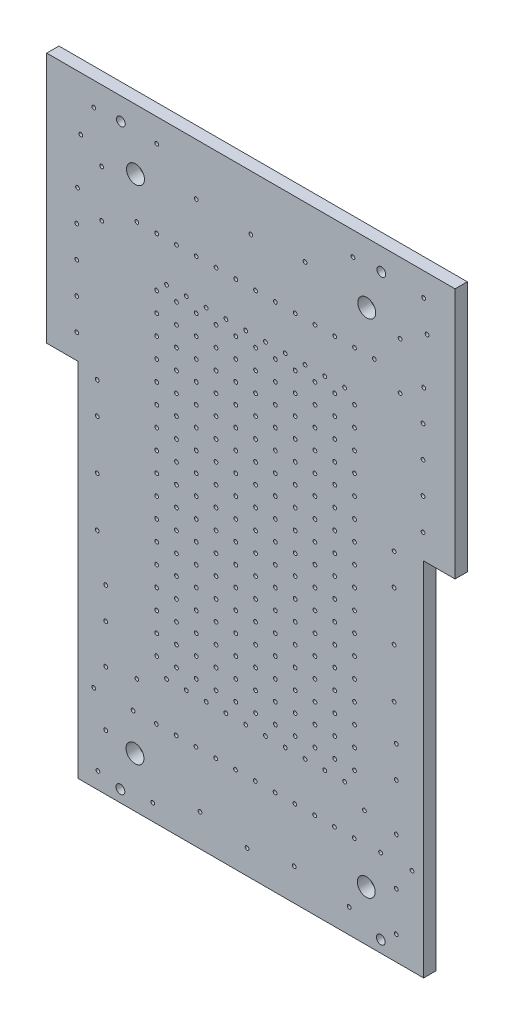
from build123d import *

# Parameters (mm, degrees)
SKETCH1_R           = 0.7239
SKETCH1_R_2         = 0.3556
SKETCH1_R_3         = 0.1524
BOSS_EXTRUDE1_DEPTH = 0.9910064


with BuildPart() as part:
    # Sketch1 → Boss-Extrude1 (new body)
    with BuildSketch(Plane.XY):
        Polygon((29.25, -3.290033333), (29.25, 25.919966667), (31.79, 25.919966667), (31.79, 46.239966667), (-1.23, 46.239966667), (-1.23, 25.919966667), (1.31, 25.919966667), (1.31, -3.290033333), align=None)
        with Locations(Location((5.95, 41.35, 0), (0, 0, 180))):
            Circle(SKETCH1_R, mode=Mode.SUBTRACT)
        with Locations(Location((24.65, 41.35, 0), (0, 0, 180))):
            Circle(SKETCH1_R, mode=Mode.SUBTRACT)
        with Locations(Location((4.77, 44.45, 0), (0, 0, 180))):
            Circle(SKETCH1_R_2, mode=Mode.SUBTRACT)
        with Locations(Location((25.83, 44.45, 0), (0, 0, 180))):
            Circle(SKETCH1_R_2, mode=Mode.SUBTRACT)
        with Locations(Location((18.785, -0.69, 0), (0, 0, 180))):
            Circle(SKETCH1_R_3, mode=Mode.SUBTRACT)
        with Locations(Location((14.975, -1.325, 0), (0, 0, 180))):
            Circle(SKETCH1_R_3, mode=Mode.SUBTRACT)
        with Locations(Location((11.165, -0.69, 0), (0, 0, 180))):
            Circle(SKETCH1_R_3, mode=Mode.SUBTRACT)
        with Locations(Location((2.91, -1.96, 0), (0, 0, 180))):
            Circle(SKETCH1_R_3, mode=Mode.SUBTRACT)
        with Locations(Location((7.355, -1.96, 0), (0, 0, 180))):
            Circle(SKETCH1_R_3, mode=Mode.SUBTRACT)
        with Locations(Location((23.23, -1.325, 0), (0, 0, 180))):
            Circle(SKETCH1_R_3, mode=Mode.SUBTRACT)
        with Locations(Location((27.04, -1.325, 0), (0, 0, 180))):
            Circle(SKETCH1_R_3, mode=Mode.SUBTRACT)
        with Locations(Location((3.545, 11.375, 0), (0, 0, 180))):
            Circle(SKETCH1_R_3, mode=Mode.SUBTRACT)
        with Locations(Location((3.545, 8.835, 0), (0, 0, 180))):
            Circle(SKETCH1_R_3, mode=Mode.SUBTRACT)
        with Locations(Location((27.04, 12.01, 0), (0, 0, 180))):
            Circle(SKETCH1_R_3, mode=Mode.SUBTRACT)
        with Locations(Location((27.04, 9.47, 0), (0, 0, 180))):
            Circle(SKETCH1_R_3, mode=Mode.SUBTRACT)
        with Locations(Location((28.31, 3.755, 0), (0, 0, 180))):
            Circle(SKETCH1_R_3, mode=Mode.SUBTRACT)
        with Locations(Location((27.04, 5.66, 0), (0, 0, 180))):
            Circle(SKETCH1_R_3, mode=Mode.SUBTRACT)
        with Locations(Location((25.77, 3.755, 0), (0, 0, 180))):
            Circle(SKETCH1_R_3, mode=Mode.SUBTRACT)
        with Locations(Location((27.04, 1.85, 0), (0, 0, 180))):
            Circle(SKETCH1_R_3, mode=Mode.SUBTRACT)
        with Locations(Location((3.545, 5.66, 0), (0, 0, 180))):
            Circle(SKETCH1_R_3, mode=Mode.SUBTRACT)
        with Locations(Location((2.58, 3.694966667, 0), (0, 0, 180))):
            Circle(SKETCH1_R_3, mode=Mode.SUBTRACT)
        with Locations(Location((3.545, 1.215, 0), (0, 0, 180))):
            Circle(SKETCH1_R_3, mode=Mode.SUBTRACT)
        with Locations(Location((5.755, 3.694966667, 0), (0, 0, 180))):
            Circle(SKETCH1_R_3, mode=Mode.SUBTRACT)
        with Locations(Location((27.345, 36.714966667, 0), (0, 0, 180))):
            Circle(SKETCH1_R_3, mode=Mode.SUBTRACT)
        with Locations(Location((27.345, 40.524966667, 0), (0, 0, 180))):
            Circle(SKETCH1_R_3, mode=Mode.SUBTRACT)
        with Locations(Location((2.58, 44.334966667, 0), (0, 0, 180))):
            Circle(SKETCH1_R_3, mode=Mode.SUBTRACT)
        with Locations(Location((7.66, 44.334966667, 0), (0, 0, 180))):
            Circle(SKETCH1_R_3, mode=Mode.SUBTRACT)
        with Locations(Location((29.25, 44.334966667, 0), (0, 0, 180))):
            Circle(SKETCH1_R_3, mode=Mode.SUBTRACT)
        with Locations(Location((23.535, 44.334966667, 0), (0, 0, 180))):
            Circle(SKETCH1_R_3, mode=Mode.SUBTRACT)
        with Locations(Location((15.28, 41.794966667, 0), (0, 0, 180))):
            Circle(SKETCH1_R_3, mode=Mode.SUBTRACT)
        with Locations(Location((3.215, 40.524966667, 0), (0, 0, 180))):
            Circle(SKETCH1_R_3, mode=Mode.SUBTRACT)
        with Locations(Location((3.215, 36.714966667, 0), (0, 0, 180))):
            Circle(SKETCH1_R_3, mode=Mode.SUBTRACT)
        with Locations(Location((29.53, 41.909966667, 0), (0, 0, 180))):
            Circle(SKETCH1_R_3, mode=Mode.SUBTRACT)
        with Locations(Location((1.53, 41.909966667, 0), (0, 0, 180))):
            Circle(SKETCH1_R_3, mode=Mode.SUBTRACT)
        with Locations(Location((26.86, 25.399966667, 0), (0, 0, 180))):
            Circle(SKETCH1_R_3, mode=Mode.SUBTRACT)
        with Locations(Location((2.86, 25.399966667, 0), (0, 0, 180))):
            Circle(SKETCH1_R_3, mode=Mode.SUBTRACT)
        with Locations(Location((29.2, 27.899966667, 0), (0, 0, 180))):
            Circle(SKETCH1_R_3, mode=Mode.SUBTRACT)
        with Locations(Location((1.2, 27.899966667, 0), (0, 0, 180))):
            Circle(SKETCH1_R_3, mode=Mode.SUBTRACT)
        with Locations(Location((29.2, 30.439966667, 0), (0, 0, 180))):
            Circle(SKETCH1_R_3, mode=Mode.SUBTRACT)
        with Locations(Location((1.2, 30.439966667, 0), (0, 0, 180))):
            Circle(SKETCH1_R_3, mode=Mode.SUBTRACT)
        with Locations(Location((29.2, 32.979966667, 0), (0, 0, 180))):
            Circle(SKETCH1_R_3, mode=Mode.SUBTRACT)
        with Locations(Location((1.2, 32.979966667, 0), (0, 0, 180))):
            Circle(SKETCH1_R_3, mode=Mode.SUBTRACT)
        with Locations(Location((23.66, 10.06, 0), (0, 0, 180))):
            Circle(SKETCH1_R_3, mode=Mode.SUBTRACT)
        with Locations(Location((23.66, 13.26, 0), (0, 0, 180))):
            Circle(SKETCH1_R_3, mode=Mode.SUBTRACT)
        with Locations(Location((23.66, 16.46, 0), (0, 0, 180))):
            Circle(SKETCH1_R_3, mode=Mode.SUBTRACT)
        with Locations(Location((23.66, 19.66, 0), (0, 0, 180))):
            Circle(SKETCH1_R_3, mode=Mode.SUBTRACT)
        with Locations(Location((23.66, 22.86, 0), (0, 0, 180))):
            Circle(SKETCH1_R_3, mode=Mode.SUBTRACT)
        with Locations(Location((23.66, 32.46, 0), (0, 0, 180))):
            Circle(SKETCH1_R_3, mode=Mode.SUBTRACT)
        with Locations(Location((22.06, 10.06, 0), (0, 0, 180))):
            Circle(SKETCH1_R_3, mode=Mode.SUBTRACT)
        with Locations(Location((22.06, 13.26, 0), (0, 0, 180))):
            Circle(SKETCH1_R_3, mode=Mode.SUBTRACT)
        with Locations(Location((22.06, 16.46, 0), (0, 0, 180))):
            Circle(SKETCH1_R_3, mode=Mode.SUBTRACT)
        with Locations(Location((22.06, 19.66, 0), (0, 0, 180))):
            Circle(SKETCH1_R_3, mode=Mode.SUBTRACT)
        with Locations(Location((22.06, 22.86, 0), (0, 0, 180))):
            Circle(SKETCH1_R_3, mode=Mode.SUBTRACT)
        with Locations(Location((22.06, 32.46, 0), (0, 0, 180))):
            Circle(SKETCH1_R_3, mode=Mode.SUBTRACT)
        with Locations(Location((20.46, 10.06, 0), (0, 0, 180))):
            Circle(SKETCH1_R_3, mode=Mode.SUBTRACT)
        with Locations(Location((20.46, 13.26, 0), (0, 0, 180))):
            Circle(SKETCH1_R_3, mode=Mode.SUBTRACT)
        with Locations(Location((20.46, 16.46, 0), (0, 0, 180))):
            Circle(SKETCH1_R_3, mode=Mode.SUBTRACT)
        with Locations(Location((20.46, 19.66, 0), (0, 0, 180))):
            Circle(SKETCH1_R_3, mode=Mode.SUBTRACT)
        with Locations(Location((20.46, 22.86, 0), (0, 0, 180))):
            Circle(SKETCH1_R_3, mode=Mode.SUBTRACT)
        with Locations(Location((20.46, 32.46, 0), (0, 0, 180))):
            Circle(SKETCH1_R_3, mode=Mode.SUBTRACT)
        with Locations(Location((18.86, 10.06, 0), (0, 0, 180))):
            Circle(SKETCH1_R_3, mode=Mode.SUBTRACT)
        with Locations(Location((18.86, 13.26, 0), (0, 0, 180))):
            Circle(SKETCH1_R_3, mode=Mode.SUBTRACT)
        with Locations(Location((18.86, 16.46, 0), (0, 0, 180))):
            Circle(SKETCH1_R_3, mode=Mode.SUBTRACT)
        with Locations(Location((18.86, 19.66, 0), (0, 0, 180))):
            Circle(SKETCH1_R_3, mode=Mode.SUBTRACT)
        with Locations(Location((18.86, 22.86, 0), (0, 0, 180))):
            Circle(SKETCH1_R_3, mode=Mode.SUBTRACT)
        with Locations(Location((18.86, 32.46, 0), (0, 0, 180))):
            Circle(SKETCH1_R_3, mode=Mode.SUBTRACT)
        with Locations(Location((17.26, 10.06, 0), (0, 0, 180))):
            Circle(SKETCH1_R_3, mode=Mode.SUBTRACT)
        with Locations(Location((17.26, 13.26, 0), (0, 0, 180))):
            Circle(SKETCH1_R_3, mode=Mode.SUBTRACT)
        with Locations(Location((17.26, 16.46, 0), (0, 0, 180))):
            Circle(SKETCH1_R_3, mode=Mode.SUBTRACT)
        with Locations(Location((17.26, 19.66, 0), (0, 0, 180))):
            Circle(SKETCH1_R_3, mode=Mode.SUBTRACT)
        with Locations(Location((17.26, 22.86, 0), (0, 0, 180))):
            Circle(SKETCH1_R_3, mode=Mode.SUBTRACT)
        with Locations(Location((17.26, 32.46, 0), (0, 0, 180))):
            Circle(SKETCH1_R_3, mode=Mode.SUBTRACT)
        with Locations(Location((15.66, 10.06, 0), (0, 0, 180))):
            Circle(SKETCH1_R_3, mode=Mode.SUBTRACT)
        with Locations(Location((15.66, 13.26, 0), (0, 0, 180))):
            Circle(SKETCH1_R_3, mode=Mode.SUBTRACT)
        with Locations(Location((15.66, 16.46, 0), (0, 0, 180))):
            Circle(SKETCH1_R_3, mode=Mode.SUBTRACT)
        with Locations(Location((15.66, 19.66, 0), (0, 0, 180))):
            Circle(SKETCH1_R_3, mode=Mode.SUBTRACT)
        with Locations(Location((15.66, 22.86, 0), (0, 0, 180))):
            Circle(SKETCH1_R_3, mode=Mode.SUBTRACT)
        with Locations(Location((15.66, 32.46, 0), (0, 0, 180))):
            Circle(SKETCH1_R_3, mode=Mode.SUBTRACT)
        with Locations(Location((14.06, 10.06, 0), (0, 0, 180))):
            Circle(SKETCH1_R_3, mode=Mode.SUBTRACT)
        with Locations(Location((14.06, 13.26, 0), (0, 0, 180))):
            Circle(SKETCH1_R_3, mode=Mode.SUBTRACT)
        with Locations(Location((14.06, 16.46, 0), (0, 0, 180))):
            Circle(SKETCH1_R_3, mode=Mode.SUBTRACT)
        with Locations(Location((23.66, 26.06, 0), (0, 0, 180))):
            Circle(SKETCH1_R_3, mode=Mode.SUBTRACT)
        with Locations(Location((14.06, 19.66, 0), (0, 0, 180))):
            Circle(SKETCH1_R_3, mode=Mode.SUBTRACT)
        with Locations(Location((23.66, 29.26, 0), (0, 0, 180))):
            Circle(SKETCH1_R_3, mode=Mode.SUBTRACT)
        with Locations(Location((14.06, 22.86, 0), (0, 0, 180))):
            Circle(SKETCH1_R_3, mode=Mode.SUBTRACT)
        with Locations(Location((14.06, 32.46, 0), (0, 0, 180))):
            Circle(SKETCH1_R_3, mode=Mode.SUBTRACT)
        with Locations(Location((22.06, 26.06, 0), (0, 0, 180))):
            Circle(SKETCH1_R_3, mode=Mode.SUBTRACT)
        with Locations(Location((12.46, 10.06, 0), (0, 0, 180))):
            Circle(SKETCH1_R_3, mode=Mode.SUBTRACT)
        with Locations(Location((22.06, 29.26, 0), (0, 0, 180))):
            Circle(SKETCH1_R_3, mode=Mode.SUBTRACT)
        with Locations(Location((12.46, 13.26, 0), (0, 0, 180))):
            Circle(SKETCH1_R_3, mode=Mode.SUBTRACT)
        with Locations(Location((20.46, 26.06, 0), (0, 0, 180))):
            Circle(SKETCH1_R_3, mode=Mode.SUBTRACT)
        with Locations(Location((12.46, 16.46, 0), (0, 0, 180))):
            Circle(SKETCH1_R_3, mode=Mode.SUBTRACT)
        with Locations(Location((20.46, 29.26, 0), (0, 0, 180))):
            Circle(SKETCH1_R_3, mode=Mode.SUBTRACT)
        with Locations(Location((12.46, 19.66, 0), (0, 0, 180))):
            Circle(SKETCH1_R_3, mode=Mode.SUBTRACT)
        with Locations(Location((18.86, 26.06, 0), (0, 0, 180))):
            Circle(SKETCH1_R_3, mode=Mode.SUBTRACT)
        with Locations(Location((12.46, 22.86, 0), (0, 0, 180))):
            Circle(SKETCH1_R_3, mode=Mode.SUBTRACT)
        with Locations(Location((23.635, 3.694966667, 0), (0, 0, 180))):
            Circle(SKETCH1_R_3, mode=Mode.SUBTRACT)
        with Locations(Location((24.46, 6.059966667, 0), (0, 0, 180))):
            Circle(SKETCH1_R_3, mode=Mode.SUBTRACT)
        with Locations(Location((26.86, 14.859966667, 0), (0, 0, 180))):
            Circle(SKETCH1_R_3, mode=Mode.SUBTRACT)
        with Locations(Location((26.86, 18.859966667, 0), (0, 0, 180))):
            Circle(SKETCH1_R_3, mode=Mode.SUBTRACT)
        with Locations(Location((26.86, 22.859966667, 0), (0, 0, 180))):
            Circle(SKETCH1_R_3, mode=Mode.SUBTRACT)
        with Locations(Location((12.46, 32.46, 0), (0, 0, 180))):
            Circle(SKETCH1_R_3, mode=Mode.SUBTRACT)
        with Locations(Location((25.26, 38.059966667, 0), (0, 0, 180))):
            Circle(SKETCH1_R_3, mode=Mode.SUBTRACT)
        with Locations(Location((29.26, 38.059966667, 0), (0, 0, 180))):
            Circle(SKETCH1_R_3, mode=Mode.SUBTRACT)
        with Locations(Location((19.66, 42.059966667, 0), (0, 0, 180))):
            Circle(SKETCH1_R_3, mode=Mode.SUBTRACT)
        with Locations(Location((10.86, 42.059966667, 0), (0, 0, 180))):
            Circle(SKETCH1_R_3, mode=Mode.SUBTRACT)
        with Locations(Location((2.86, 14.859966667, 0), (0, 0, 180))):
            Circle(SKETCH1_R_3, mode=Mode.SUBTRACT)
        with Locations(Location((2.86, 18.859966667, 0), (0, 0, 180))):
            Circle(SKETCH1_R_3, mode=Mode.SUBTRACT)
        with Locations(Location((2.86, 22.859966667, 0), (0, 0, 180))):
            Circle(SKETCH1_R_3, mode=Mode.SUBTRACT)
        with Locations(Location((18.86, 29.26, 0), (0, 0, 180))):
            Circle(SKETCH1_R_3, mode=Mode.SUBTRACT)
        with Locations(Location((1.26, 38.059966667, 0), (0, 0, 180))):
            Circle(SKETCH1_R_3, mode=Mode.SUBTRACT)
        with Locations(Location((10.86, 10.06, 0), (0, 0, 180))):
            Circle(SKETCH1_R_3, mode=Mode.SUBTRACT)
        with Locations(Location((6.06, 6.06, 0), (0, 0, 180))):
            Circle(SKETCH1_R_3, mode=Mode.SUBTRACT)
        with Locations(Location((22.035, 3.694966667, 0), (0, 0, 180))):
            Circle(SKETCH1_R_3, mode=Mode.SUBTRACT)
        with Locations(Location((20.435, 3.694966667, 0), (0, 0, 180))):
            Circle(SKETCH1_R_3, mode=Mode.SUBTRACT)
        with Locations(Location((18.835, 3.694966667, 0), (0, 0, 180))):
            Circle(SKETCH1_R_3, mode=Mode.SUBTRACT)
        with Locations(Location((17.235, 3.694966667, 0), (0, 0, 180))):
            Circle(SKETCH1_R_3, mode=Mode.SUBTRACT)
        with Locations(Location((15.635, 3.694966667, 0), (0, 0, 180))):
            Circle(SKETCH1_R_3, mode=Mode.SUBTRACT)
        with Locations(Location((14.035, 3.694966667, 0), (0, 0, 180))):
            Circle(SKETCH1_R_3, mode=Mode.SUBTRACT)
        with Locations(Location((12.435, 3.694966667, 0), (0, 0, 180))):
            Circle(SKETCH1_R_3, mode=Mode.SUBTRACT)
        with Locations(Location((10.835, 3.694966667, 0), (0, 0, 180))):
            Circle(SKETCH1_R_3, mode=Mode.SUBTRACT)
        with Locations(Location((9.235, 3.694966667, 0), (0, 0, 180))):
            Circle(SKETCH1_R_3, mode=Mode.SUBTRACT)
        with Locations(Location((7.635, 3.694966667, 0), (0, 0, 180))):
            Circle(SKETCH1_R_3, mode=Mode.SUBTRACT)
        with Locations(Location((22.06, 38.059966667, 0), (0, 0, 180))):
            Circle(SKETCH1_R_3, mode=Mode.SUBTRACT)
        with Locations(Location((23.66, 38.059966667, 0), (0, 0, 180))):
            Circle(SKETCH1_R_3, mode=Mode.SUBTRACT)
        with Locations(Location((20.46, 38.059966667, 0), (0, 0, 180))):
            Circle(SKETCH1_R_3, mode=Mode.SUBTRACT)
        with Locations(Location((18.86, 38.059966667, 0), (0, 0, 180))):
            Circle(SKETCH1_R_3, mode=Mode.SUBTRACT)
        with Locations(Location((17.26, 38.059966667, 0), (0, 0, 180))):
            Circle(SKETCH1_R_3, mode=Mode.SUBTRACT)
        with Locations(Location((15.66, 38.059966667, 0), (0, 0, 180))):
            Circle(SKETCH1_R_3, mode=Mode.SUBTRACT)
        with Locations(Location((14.06, 38.059966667, 0), (0, 0, 180))):
            Circle(SKETCH1_R_3, mode=Mode.SUBTRACT)
        with Locations(Location((12.46, 38.059966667, 0), (0, 0, 180))):
            Circle(SKETCH1_R_3, mode=Mode.SUBTRACT)
        with Locations(Location((10.86, 38.059966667, 0), (0, 0, 180))):
            Circle(SKETCH1_R_3, mode=Mode.SUBTRACT)
        with Locations(Location((9.26, 38.059966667, 0), (0, 0, 180))):
            Circle(SKETCH1_R_3, mode=Mode.SUBTRACT)
        with Locations(Location((7.66, 38.059966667, 0), (0, 0, 180))):
            Circle(SKETCH1_R_3, mode=Mode.SUBTRACT)
        with Locations(Location((6.06, 38.059966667, 0), (0, 0, 180))):
            Circle(SKETCH1_R_3, mode=Mode.SUBTRACT)
        with Locations(Location((23.66, 8.46, 0), (0, 0, 180))):
            Circle(SKETCH1_R_3, mode=Mode.SUBTRACT)
        with Locations(Location((17.26, 26.06, 0), (0, 0, 180))):
            Circle(SKETCH1_R_3, mode=Mode.SUBTRACT)
        with Locations(Location((23.66, 11.66, 0), (0, 0, 180))):
            Circle(SKETCH1_R_3, mode=Mode.SUBTRACT)
        with Locations(Location((10.86, 13.26, 0), (0, 0, 180))):
            Circle(SKETCH1_R_3, mode=Mode.SUBTRACT)
        with Locations(Location((23.66, 14.86, 0), (0, 0, 180))):
            Circle(SKETCH1_R_3, mode=Mode.SUBTRACT)
        with Locations(Location((17.26, 29.26, 0), (0, 0, 180))):
            Circle(SKETCH1_R_3, mode=Mode.SUBTRACT)
        with Locations(Location((23.66, 18.06, 0), (0, 0, 180))):
            Circle(SKETCH1_R_3, mode=Mode.SUBTRACT)
        with Locations(Location((10.86, 16.46, 0), (0, 0, 180))):
            Circle(SKETCH1_R_3, mode=Mode.SUBTRACT)
        with Locations(Location((23.66, 21.26, 0), (0, 0, 180))):
            Circle(SKETCH1_R_3, mode=Mode.SUBTRACT)
        with Locations(Location((15.66, 26.06, 0), (0, 0, 180))):
            Circle(SKETCH1_R_3, mode=Mode.SUBTRACT)
        with Locations(Location((23.66, 24.46, 0), (0, 0, 180))):
            Circle(SKETCH1_R_3, mode=Mode.SUBTRACT)
        with Locations(Location((23.66, 34.06, 0), (0, 0, 180))):
            Circle(SKETCH1_R_3, mode=Mode.SUBTRACT)
        with Locations(Location((22.06, 8.46, 0), (0, 0, 180))):
            Circle(SKETCH1_R_3, mode=Mode.SUBTRACT)
        with Locations(Location((10.86, 19.66, 0), (0, 0, 180))):
            Circle(SKETCH1_R_3, mode=Mode.SUBTRACT)
        with Locations(Location((22.06, 11.66, 0), (0, 0, 180))):
            Circle(SKETCH1_R_3, mode=Mode.SUBTRACT)
        with Locations(Location((15.66, 29.26, 0), (0, 0, 180))):
            Circle(SKETCH1_R_3, mode=Mode.SUBTRACT)
        with Locations(Location((22.06, 14.86, 0), (0, 0, 180))):
            Circle(SKETCH1_R_3, mode=Mode.SUBTRACT)
        with Locations(Location((10.86, 22.86, 0), (0, 0, 180))):
            Circle(SKETCH1_R_3, mode=Mode.SUBTRACT)
        with Locations(Location((22.06, 18.06, 0), (0, 0, 180))):
            Circle(SKETCH1_R_3, mode=Mode.SUBTRACT)
        with Locations(Location((10.86, 32.46, 0), (0, 0, 180))):
            Circle(SKETCH1_R_3, mode=Mode.SUBTRACT)
        with Locations(Location((22.06, 21.26, 0), (0, 0, 180))):
            Circle(SKETCH1_R_3, mode=Mode.SUBTRACT)
        with Locations(Location((14.06, 26.06, 0), (0, 0, 180))):
            Circle(SKETCH1_R_3, mode=Mode.SUBTRACT)
        with Locations(Location((22.06, 24.46, 0), (0, 0, 180))):
            Circle(SKETCH1_R_3, mode=Mode.SUBTRACT)
        with Locations(Location((22.06, 34.06, 0), (0, 0, 180))):
            Circle(SKETCH1_R_3, mode=Mode.SUBTRACT)
        with Locations(Location((20.46, 8.46, 0), (0, 0, 180))):
            Circle(SKETCH1_R_3, mode=Mode.SUBTRACT)
        with Locations(Location((9.26, 10.06, 0), (0, 0, 180))):
            Circle(SKETCH1_R_3, mode=Mode.SUBTRACT)
        with Locations(Location((20.46, 11.66, 0), (0, 0, 180))):
            Circle(SKETCH1_R_3, mode=Mode.SUBTRACT)
        with Locations(Location((14.06, 29.26, 0), (0, 0, 180))):
            Circle(SKETCH1_R_3, mode=Mode.SUBTRACT)
        with Locations(Location((20.46, 14.86, 0), (0, 0, 180))):
            Circle(SKETCH1_R_3, mode=Mode.SUBTRACT)
        with Locations(Location((9.26, 13.26, 0), (0, 0, 180))):
            Circle(SKETCH1_R_3, mode=Mode.SUBTRACT)
        with Locations(Location((20.46, 18.06, 0), (0, 0, 180))):
            Circle(SKETCH1_R_3, mode=Mode.SUBTRACT)
        with Locations(Location((12.46, 26.06, 0), (0, 0, 180))):
            Circle(SKETCH1_R_3, mode=Mode.SUBTRACT)
        with Locations(Location((20.46, 21.26, 0), (0, 0, 180))):
            Circle(SKETCH1_R_3, mode=Mode.SUBTRACT)
        with Locations(Location((9.26, 16.46, 0), (0, 0, 180))):
            Circle(SKETCH1_R_3, mode=Mode.SUBTRACT)
        with Locations(Location((20.46, 24.46, 0), (0, 0, 180))):
            Circle(SKETCH1_R_3, mode=Mode.SUBTRACT)
        with Locations(Location((20.46, 34.06, 0), (0, 0, 180))):
            Circle(SKETCH1_R_3, mode=Mode.SUBTRACT)
        with Locations(Location((18.86, 8.46, 0), (0, 0, 180))):
            Circle(SKETCH1_R_3, mode=Mode.SUBTRACT)
        with Locations(Location((12.46, 29.26, 0), (0, 0, 180))):
            Circle(SKETCH1_R_3, mode=Mode.SUBTRACT)
        with Locations(Location((18.86, 11.66, 0), (0, 0, 180))):
            Circle(SKETCH1_R_3, mode=Mode.SUBTRACT)
        with Locations(Location((9.26, 19.66, 0), (0, 0, 180))):
            Circle(SKETCH1_R_3, mode=Mode.SUBTRACT)
        with Locations(Location((18.86, 14.86, 0), (0, 0, 180))):
            Circle(SKETCH1_R_3, mode=Mode.SUBTRACT)
        with Locations(Location((10.86, 26.06, 0), (0, 0, 180))):
            Circle(SKETCH1_R_3, mode=Mode.SUBTRACT)
        with Locations(Location((18.86, 18.06, 0), (0, 0, 180))):
            Circle(SKETCH1_R_3, mode=Mode.SUBTRACT)
        with Locations(Location((9.26, 22.86, 0), (0, 0, 180))):
            Circle(SKETCH1_R_3, mode=Mode.SUBTRACT)
        with Locations(Location((18.86, 21.26, 0), (0, 0, 180))):
            Circle(SKETCH1_R_3, mode=Mode.SUBTRACT)
        with Locations(Location((9.26, 32.46, 0), (0, 0, 180))):
            Circle(SKETCH1_R_3, mode=Mode.SUBTRACT)
        with Locations(Location((18.86, 24.46, 0), (0, 0, 180))):
            Circle(SKETCH1_R_3, mode=Mode.SUBTRACT)
        with Locations(Location((18.86, 34.06, 0), (0, 0, 180))):
            Circle(SKETCH1_R_3, mode=Mode.SUBTRACT)
        with Locations(Location((17.26, 8.46, 0), (0, 0, 180))):
            Circle(SKETCH1_R_3, mode=Mode.SUBTRACT)
        with Locations(Location((10.86, 29.26, 0), (0, 0, 180))):
            Circle(SKETCH1_R_3, mode=Mode.SUBTRACT)
        with Locations(Location((17.26, 11.66, 0), (0, 0, 180))):
            Circle(SKETCH1_R_3, mode=Mode.SUBTRACT)
        with Locations(Location((7.66, 10.06, 0), (0, 0, 180))):
            Circle(SKETCH1_R_3, mode=Mode.SUBTRACT)
        with Locations(Location((17.26, 14.86, 0), (0, 0, 180))):
            Circle(SKETCH1_R_3, mode=Mode.SUBTRACT)
        with Locations(Location((9.26, 26.06, 0), (0, 0, 180))):
            Circle(SKETCH1_R_3, mode=Mode.SUBTRACT)
        with Locations(Location((17.26, 18.06, 0), (0, 0, 180))):
            Circle(SKETCH1_R_3, mode=Mode.SUBTRACT)
        with Locations(Location((7.66, 13.26, 0), (0, 0, 180))):
            Circle(SKETCH1_R_3, mode=Mode.SUBTRACT)
        with Locations(Location((17.26, 21.26, 0), (0, 0, 180))):
            Circle(SKETCH1_R_3, mode=Mode.SUBTRACT)
        with Locations(Location((9.26, 29.26, 0), (0, 0, 180))):
            Circle(SKETCH1_R_3, mode=Mode.SUBTRACT)
        with Locations(Location((17.26, 24.46, 0), (0, 0, 180))):
            Circle(SKETCH1_R_3, mode=Mode.SUBTRACT)
        with Locations(Location((17.26, 34.06, 0), (0, 0, 180))):
            Circle(SKETCH1_R_3, mode=Mode.SUBTRACT)
        with Locations(Location((15.66, 8.46, 0), (0, 0, 180))):
            Circle(SKETCH1_R_3, mode=Mode.SUBTRACT)
        with Locations(Location((7.66, 16.46, 0), (0, 0, 180))):
            Circle(SKETCH1_R_3, mode=Mode.SUBTRACT)
        with Locations(Location((15.66, 11.66, 0), (0, 0, 180))):
            Circle(SKETCH1_R_3, mode=Mode.SUBTRACT)
        with Locations(Location((7.66, 26.06, 0), (0, 0, 180))):
            Circle(SKETCH1_R_3, mode=Mode.SUBTRACT)
        with Locations(Location((15.66, 14.86, 0), (0, 0, 180))):
            Circle(SKETCH1_R_3, mode=Mode.SUBTRACT)
        with Locations(Location((7.66, 19.66, 0), (0, 0, 180))):
            Circle(SKETCH1_R_3, mode=Mode.SUBTRACT)
        with Locations(Location((15.66, 18.06, 0), (0, 0, 180))):
            Circle(SKETCH1_R_3, mode=Mode.SUBTRACT)
        with Locations(Location((7.66, 29.26, 0), (0, 0, 180))):
            Circle(SKETCH1_R_3, mode=Mode.SUBTRACT)
        with Locations(Location((15.66, 21.26, 0), (0, 0, 180))):
            Circle(SKETCH1_R_3, mode=Mode.SUBTRACT)
        with Locations(Location((7.66, 22.86, 0), (0, 0, 180))):
            Circle(SKETCH1_R_3, mode=Mode.SUBTRACT)
        with Locations(Location((15.66, 24.46, 0), (0, 0, 180))):
            Circle(SKETCH1_R_3, mode=Mode.SUBTRACT)
        with Locations(Location((15.66, 34.06, 0), (0, 0, 180))):
            Circle(SKETCH1_R_3, mode=Mode.SUBTRACT)
        with Locations(Location((14.06, 8.46, 0), (0, 0, 180))):
            Circle(SKETCH1_R_3, mode=Mode.SUBTRACT)
        with Locations(Location((7.66, 32.46, 0), (0, 0, 180))):
            Circle(SKETCH1_R_3, mode=Mode.SUBTRACT)
        with Locations(Location((14.06, 11.66, 0), (0, 0, 180))):
            Circle(SKETCH1_R_3, mode=Mode.SUBTRACT)
        with Locations(Location((29.2, 35.519966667, 0), (0, 0, 180))):
            Circle(SKETCH1_R_3, mode=Mode.SUBTRACT)
        with Locations(Location((14.06, 14.86, 0), (0, 0, 180))):
            Circle(SKETCH1_R_3, mode=Mode.SUBTRACT)
        with Locations(Location((1.2, 35.519966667, 0), (0, 0, 180))):
            Circle(SKETCH1_R_3, mode=Mode.SUBTRACT)
        with Locations(Location((14.06, 18.06, 0), (0, 0, 180))):
            Circle(SKETCH1_R_3, mode=Mode.SUBTRACT)
        with Locations(Location((23.66, 27.66, 0), (0, 0, 180))):
            Circle(SKETCH1_R_3, mode=Mode.SUBTRACT)
        with Locations(Location((14.06, 21.26, 0), (0, 0, 180))):
            Circle(SKETCH1_R_3, mode=Mode.SUBTRACT)
        with Locations(Location((23.66, 30.86, 0), (0, 0, 180))):
            Circle(SKETCH1_R_3, mode=Mode.SUBTRACT)
        with Locations(Location((14.06, 24.46, 0), (0, 0, 180))):
            Circle(SKETCH1_R_3, mode=Mode.SUBTRACT)
        with Locations(Location((14.06, 34.06, 0), (0, 0, 180))):
            Circle(SKETCH1_R_3, mode=Mode.SUBTRACT)
        with Locations(Location((12.46, 8.46, 0), (0, 0, 180))):
            Circle(SKETCH1_R_3, mode=Mode.SUBTRACT)
        with Locations(Location((22.06, 27.66, 0), (0, 0, 180))):
            Circle(SKETCH1_R_3, mode=Mode.SUBTRACT)
        with Locations(Location((12.46, 11.66, 0), (0, 0, 180))):
            Circle(SKETCH1_R_3, mode=Mode.SUBTRACT)
        with Locations(Location((22.06, 30.86, 0), (0, 0, 180))):
            Circle(SKETCH1_R_3, mode=Mode.SUBTRACT)
        with Locations(Location((12.46, 14.86, 0), (0, 0, 180))):
            Circle(SKETCH1_R_3, mode=Mode.SUBTRACT)
        with Locations(Location((20.46, 27.66, 0), (0, 0, 180))):
            Circle(SKETCH1_R_3, mode=Mode.SUBTRACT)
        with Locations(Location((12.46, 18.06, 0), (0, 0, 180))):
            Circle(SKETCH1_R_3, mode=Mode.SUBTRACT)
        with Locations(Location((20.46, 30.86, 0), (0, 0, 180))):
            Circle(SKETCH1_R_3, mode=Mode.SUBTRACT)
        with Locations(Location((12.46, 21.26, 0), (0, 0, 180))):
            Circle(SKETCH1_R_3, mode=Mode.SUBTRACT)
        with Locations(Location((18.86, 27.66, 0), (0, 0, 180))):
            Circle(SKETCH1_R_3, mode=Mode.SUBTRACT)
        with Locations(Location((12.46, 24.46, 0), (0, 0, 180))):
            Circle(SKETCH1_R_3, mode=Mode.SUBTRACT)
        with Locations(Location((12.46, 34.06, 0), (0, 0, 180))):
            Circle(SKETCH1_R_3, mode=Mode.SUBTRACT)
        with Locations(Location((10.86, 8.46, 0), (0, 0, 180))):
            Circle(SKETCH1_R_3, mode=Mode.SUBTRACT)
        with Locations(Location((18.86, 30.86, 0), (0, 0, 180))):
            Circle(SKETCH1_R_3, mode=Mode.SUBTRACT)
        with Locations(Location((10.86, 11.66, 0), (0, 0, 180))):
            Circle(SKETCH1_R_3, mode=Mode.SUBTRACT)
        with Locations(Location((17.26, 27.66, 0), (0, 0, 180))):
            Circle(SKETCH1_R_3, mode=Mode.SUBTRACT)
        with Locations(Location((10.86, 14.86, 0), (0, 0, 180))):
            Circle(SKETCH1_R_3, mode=Mode.SUBTRACT)
        with Locations(Location((17.26, 30.86, 0), (0, 0, 180))):
            Circle(SKETCH1_R_3, mode=Mode.SUBTRACT)
        with Locations(Location((10.86, 18.06, 0), (0, 0, 180))):
            Circle(SKETCH1_R_3, mode=Mode.SUBTRACT)
        with Locations(Location((15.66, 27.66, 0), (0, 0, 180))):
            Circle(SKETCH1_R_3, mode=Mode.SUBTRACT)
        with Locations(Location((10.86, 21.26, 0), (0, 0, 180))):
            Circle(SKETCH1_R_3, mode=Mode.SUBTRACT)
        with Locations(Location((15.66, 30.86, 0), (0, 0, 180))):
            Circle(SKETCH1_R_3, mode=Mode.SUBTRACT)
        with Locations(Location((10.86, 24.46, 0), (0, 0, 180))):
            Circle(SKETCH1_R_3, mode=Mode.SUBTRACT)
        with Locations(Location((10.86, 34.06, 0), (0, 0, 180))):
            Circle(SKETCH1_R_3, mode=Mode.SUBTRACT)
        with Locations(Location((9.26, 8.46, 0), (0, 0, 180))):
            Circle(SKETCH1_R_3, mode=Mode.SUBTRACT)
        with Locations(Location((14.06, 27.66, 0), (0, 0, 180))):
            Circle(SKETCH1_R_3, mode=Mode.SUBTRACT)
        with Locations(Location((9.26, 11.66, 0), (0, 0, 180))):
            Circle(SKETCH1_R_3, mode=Mode.SUBTRACT)
        with Locations(Location((14.06, 30.86, 0), (0, 0, 180))):
            Circle(SKETCH1_R_3, mode=Mode.SUBTRACT)
        with Locations(Location((9.26, 14.86, 0), (0, 0, 180))):
            Circle(SKETCH1_R_3, mode=Mode.SUBTRACT)
        with Locations(Location((12.46, 27.66, 0), (0, 0, 180))):
            Circle(SKETCH1_R_3, mode=Mode.SUBTRACT)
        with Locations(Location((9.26, 18.06, 0), (0, 0, 180))):
            Circle(SKETCH1_R_3, mode=Mode.SUBTRACT)
        with Locations(Location((12.46, 30.86, 0), (0, 0, 180))):
            Circle(SKETCH1_R_3, mode=Mode.SUBTRACT)
        with Locations(Location((9.26, 21.26, 0), (0, 0, 180))):
            Circle(SKETCH1_R_3, mode=Mode.SUBTRACT)
        with Locations(Location((10.86, 27.66, 0), (0, 0, 180))):
            Circle(SKETCH1_R_3, mode=Mode.SUBTRACT)
        with Locations(Location((9.26, 24.46, 0), (0, 0, 180))):
            Circle(SKETCH1_R_3, mode=Mode.SUBTRACT)
        with Locations(Location((9.26, 34.06, 0), (0, 0, 180))):
            Circle(SKETCH1_R_3, mode=Mode.SUBTRACT)
        with Locations(Location((7.66, 8.46, 0), (0, 0, 180))):
            Circle(SKETCH1_R_3, mode=Mode.SUBTRACT)
        with Locations(Location((10.86, 30.86, 0), (0, 0, 180))):
            Circle(SKETCH1_R_3, mode=Mode.SUBTRACT)
        with Locations(Location((7.66, 11.66, 0), (0, 0, 180))):
            Circle(SKETCH1_R_3, mode=Mode.SUBTRACT)
        with Locations(Location((9.26, 27.66, 0), (0, 0, 180))):
            Circle(SKETCH1_R_3, mode=Mode.SUBTRACT)
        with Locations(Location((7.66, 14.86, 0), (0, 0, 180))):
            Circle(SKETCH1_R_3, mode=Mode.SUBTRACT)
        with Locations(Location((9.26, 30.86, 0), (0, 0, 180))):
            Circle(SKETCH1_R_3, mode=Mode.SUBTRACT)
        with Locations(Location((7.66, 18.06, 0), (0, 0, 180))):
            Circle(SKETCH1_R_3, mode=Mode.SUBTRACT)
        with Locations(Location((7.66, 27.66, 0), (0, 0, 180))):
            Circle(SKETCH1_R_3, mode=Mode.SUBTRACT)
        with Locations(Location((7.66, 21.26, 0), (0, 0, 180))):
            Circle(SKETCH1_R_3, mode=Mode.SUBTRACT)
        with Locations(Location((7.66, 30.86, 0), (0, 0, 180))):
            Circle(SKETCH1_R_3, mode=Mode.SUBTRACT)
        with Locations(Location((7.66, 24.46, 0), (0, 0, 180))):
            Circle(SKETCH1_R_3, mode=Mode.SUBTRACT)
        with Locations(Location((7.66, 34.06, 0), (0, 0, 180))):
            Circle(SKETCH1_R_3, mode=Mode.SUBTRACT)
        with Locations(Location((22.86, 7.26, 0), (0, 0, 180))):
            Circle(SKETCH1_R_3, mode=Mode.SUBTRACT)
        with Locations(Location((21.26, 7.26, 0), (0, 0, 180))):
            Circle(SKETCH1_R_3, mode=Mode.SUBTRACT)
        with Locations(Location((19.66, 7.26, 0), (0, 0, 180))):
            Circle(SKETCH1_R_3, mode=Mode.SUBTRACT)
        with Locations(Location((18.06, 7.26, 0), (0, 0, 180))):
            Circle(SKETCH1_R_3, mode=Mode.SUBTRACT)
        with Locations(Location((16.46, 7.26, 0), (0, 0, 180))):
            Circle(SKETCH1_R_3, mode=Mode.SUBTRACT)
        with Locations(Location((14.86, 7.26, 0), (0, 0, 180))):
            Circle(SKETCH1_R_3, mode=Mode.SUBTRACT)
        with Locations(Location((13.26, 7.26, 0), (0, 0, 180))):
            Circle(SKETCH1_R_3, mode=Mode.SUBTRACT)
        with Locations(Location((11.66, 7.26, 0), (0, 0, 180))):
            Circle(SKETCH1_R_3, mode=Mode.SUBTRACT)
        with Locations(Location((10.06, 7.26, 0), (0, 0, 180))):
            Circle(SKETCH1_R_3, mode=Mode.SUBTRACT)
        with Locations(Location((8.46, 7.26, 0), (0, 0, 180))):
            Circle(SKETCH1_R_3, mode=Mode.SUBTRACT)
        with Locations(Location((22.86, 34.86, 0), (0, 0, 180))):
            Circle(SKETCH1_R_3, mode=Mode.SUBTRACT)
        with Locations(Location((21.26, 34.86, 0), (0, 0, 180))):
            Circle(SKETCH1_R_3, mode=Mode.SUBTRACT)
        with Locations(Location((19.66, 34.86, 0), (0, 0, 180))):
            Circle(SKETCH1_R_3, mode=Mode.SUBTRACT)
        with Locations(Location((18.06, 34.86, 0), (0, 0, 180))):
            Circle(SKETCH1_R_3, mode=Mode.SUBTRACT)
        with Locations(Location((16.46, 34.86, 0), (0, 0, 180))):
            Circle(SKETCH1_R_3, mode=Mode.SUBTRACT)
        with Locations(Location((14.86, 34.86, 0), (0, 0, 180))):
            Circle(SKETCH1_R_3, mode=Mode.SUBTRACT)
        with Locations(Location((13.26, 34.86, 0), (0, 0, 180))):
            Circle(SKETCH1_R_3, mode=Mode.SUBTRACT)
        with Locations(Location((11.66, 34.86, 0), (0, 0, 180))):
            Circle(SKETCH1_R_3, mode=Mode.SUBTRACT)
        with Locations(Location((10.06, 34.86, 0), (0, 0, 180))):
            Circle(SKETCH1_R_3, mode=Mode.SUBTRACT)
        with Locations(Location((8.46, 34.86, 0), (0, 0, 180))):
            Circle(SKETCH1_R_3, mode=Mode.SUBTRACT)
        with Locations(Location((24.61, 0.769966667, 0), (0, 0, 180))):
            Circle(SKETCH1_R, mode=Mode.SUBTRACT)
        with Locations(Location((5.91, 0.769966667, 0), (0, 0, 180))):
            Circle(SKETCH1_R, mode=Mode.SUBTRACT)
        with Locations(Location((25.79, -2.330033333, 0), (0, 0, 180))):
            Circle(SKETCH1_R_2, mode=Mode.SUBTRACT)
        with Locations(Location((4.73, -2.330033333, 0), (0, 0, 180))):
            Circle(SKETCH1_R_2, mode=Mode.SUBTRACT)
    extrude(amount=-BOSS_EXTRUDE1_DEPTH)


solid = part.part
